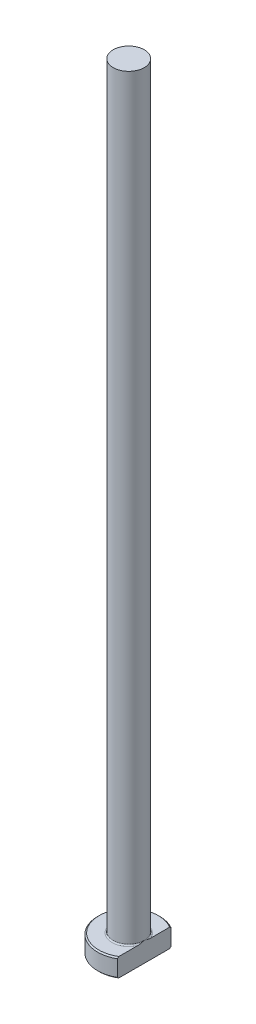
ISO-10303-21;
HEADER;
FILE_DESCRIPTION(('STEP AP214'),'2;1');
FILE_NAME('part.step','',(''),(''),'','','');
FILE_SCHEMA(('AUTOMOTIVE_DESIGN { 1 0 10303 214 1 1 1 1 }'));
ENDSEC;
DATA;
#1=APPLICATION_CONTEXT('core data for automotive mechanical design processes');
#2=APPLICATION_PROTOCOL_DEFINITION('international standard','automotive_design',2000,#1);
#3=PRODUCT_CONTEXT('',#1,'mechanical');
#4=PRODUCT('Part','Part','',(#3));
#5=PRODUCT_RELATED_PRODUCT_CATEGORY('part','',(#4));
#6=PRODUCT_DEFINITION_FORMATION('','',#4);
#7=PRODUCT_DEFINITION_CONTEXT('part definition',#1,'design');
#8=PRODUCT_DEFINITION('design','',#6,#7);
#9=PRODUCT_DEFINITION_SHAPE('','',#8);
#10=(LENGTH_UNIT() NAMED_UNIT(*) SI_UNIT(.MILLI.,.METRE.));
#11=(NAMED_UNIT(*) PLANE_ANGLE_UNIT() SI_UNIT($,.RADIAN.));
#12=(NAMED_UNIT(*) SI_UNIT($,.STERADIAN.) SOLID_ANGLE_UNIT());
#13=UNCERTAINTY_MEASURE_WITH_UNIT(LENGTH_MEASURE(1.E-05),#10,'distance_accuracy_value','');
#14=(GEOMETRIC_REPRESENTATION_CONTEXT(3) GLOBAL_UNCERTAINTY_ASSIGNED_CONTEXT((#13)) GLOBAL_UNIT_ASSIGNED_CONTEXT((#10,
#11,#12)) REPRESENTATION_CONTEXT('',''));
#15=CARTESIAN_POINT('',(0.,0.,0.));
#16=DIRECTION('',(0.,0.,1.));
#17=DIRECTION('',(1.,0.,0.));
#18=AXIS2_PLACEMENT_3D('',#15,#16,#17);
#19=CARTESIAN_POINT('',(0.,0.,0.));
#20=DIRECTION('',(0.,-1.,0.));
#21=DIRECTION('',(0.,0.,-1.));
#22=AXIS2_PLACEMENT_3D('',#19,#20,#21);
#23=PLANE('',#22);
#24=CARTESIAN_POINT('',(0.,0.,0.));
#25=DIRECTION('',(0.,-1.,0.));
#26=DIRECTION('',(0.,0.,-1.));
#27=AXIS2_PLACEMENT_3D('',#24,#25,#26);
#28=CIRCLE('',#27,4.79999999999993);
#29=CARTESIAN_POINT('',(2.49999999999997,0.,4.09756024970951));
#30=VERTEX_POINT('',#29);
#31=CARTESIAN_POINT('',(2.49999999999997,0.,-4.09756024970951));
#32=VERTEX_POINT('',#31);
#33=EDGE_CURVE('E98',#30,#32,#28,.T.);
#34=ORIENTED_EDGE('',*,*,#33,.T.);
#35=DIRECTION('',(0.,0.,1.));
#36=VECTOR('',#35,1.);
#37=CARTESIAN_POINT('',(2.49999999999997,0.,-4.33012701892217));
#38=LINE('',#37,#36);
#39=EDGE_CURVE('E83',#32,#30,#38,.T.);
#40=ORIENTED_EDGE('',*,*,#39,.T.);
#41=EDGE_LOOP('',(#34,#40));
#42=FACE_BOUND('',#41,.T.);
#43=ADVANCED_FACE('F32',(#42),#23,.T.);
#44=CARTESIAN_POINT('',(0.,259.958771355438,0.));
#45=DIRECTION('',(0.,1.,0.));
#46=DIRECTION('',(0.,0.,1.));
#47=AXIS2_PLACEMENT_3D('',#44,#45,#46);
#48=CYLINDRICAL_SURFACE('',#47,4.99999999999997);
#49=CARTESIAN_POINT('',(0.,2.80000000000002,0.));
#50=DIRECTION('',(0.,1.,0.));
#51=DIRECTION('',(0.,0.,1.));
#52=AXIS2_PLACEMENT_3D('',#49,#50,#51);
#53=CIRCLE('',#52,4.99999999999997);
#54=CARTESIAN_POINT('',(2.49999999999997,2.80000000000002,4.33012701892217));
#55=VERTEX_POINT('',#54);
#56=CARTESIAN_POINT('',(2.49999999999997,2.80000000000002,-4.33012701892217));
#57=VERTEX_POINT('',#56);
#58=EDGE_CURVE('E104',#55,#57,#53,.F.);
#59=ORIENTED_EDGE('',*,*,#58,.T.);
#60=DIRECTION('',(0.,-1.,0.));
#61=VECTOR('',#60,1.);
#62=CARTESIAN_POINT('',(2.49999999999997,125.,-4.33012701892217));
#63=LINE('',#62,#61);
#64=CARTESIAN_POINT('',(2.49999999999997,0.200000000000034,-4.33012701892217));
#65=VERTEX_POINT('',#64);
#66=EDGE_CURVE('E183',#57,#65,#63,.T.);
#67=ORIENTED_EDGE('',*,*,#66,.T.);
#68=CARTESIAN_POINT('',(0.,0.200000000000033,0.));
#69=DIRECTION('',(0.,-1.,0.));
#70=DIRECTION('',(0.,0.,-1.));
#71=AXIS2_PLACEMENT_3D('',#68,#69,#70);
#72=CIRCLE('',#71,4.99999999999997);
#73=CARTESIAN_POINT('',(2.49999999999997,0.200000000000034,4.33012701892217));
#74=VERTEX_POINT('',#73);
#75=EDGE_CURVE('E100',#65,#74,#72,.F.);
#76=ORIENTED_EDGE('',*,*,#75,.T.);
#77=DIRECTION('',(0.,-1.,0.));
#78=VECTOR('',#77,1.);
#79=CARTESIAN_POINT('',(2.49999999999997,125.,4.33012701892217));
#80=LINE('',#79,#78);
#81=EDGE_CURVE('E93',#55,#74,#80,.T.);
#82=ORIENTED_EDGE('',*,*,#81,.F.);
#83=EDGE_LOOP('',(#59,#67,#76,#82));
#84=FACE_BOUND('',#83,.T.);
#85=ADVANCED_FACE('F158',(#84),#48,.T.);
#86=CARTESIAN_POINT('',(-4.99999999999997,3.,0.));
#87=DIRECTION('',(0.,1.,0.));
#88=DIRECTION('',(0.,0.,1.));
#89=AXIS2_PLACEMENT_3D('',#86,#87,#88);
#90=PLANE('',#89);
#91=CARTESIAN_POINT('',(0.,3.,0.));
#92=DIRECTION('',(0.,1.,0.));
#93=DIRECTION('',(0.,0.,1.));
#94=AXIS2_PLACEMENT_3D('',#91,#92,#93);
#95=CIRCLE('',#94,4.79999999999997);
#96=CARTESIAN_POINT('',(2.49999999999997,3.,-4.09756024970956));
#97=VERTEX_POINT('',#96);
#98=CARTESIAN_POINT('',(2.49999999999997,3.,4.09756024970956));
#99=VERTEX_POINT('',#98);
#100=EDGE_CURVE('E178',#97,#99,#95,.T.);
#101=ORIENTED_EDGE('',*,*,#100,.T.);
#102=DIRECTION('',(0.,0.,-1.));
#103=VECTOR('',#102,1.);
#104=CARTESIAN_POINT('',(2.49999999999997,3.,0.));
#105=LINE('',#104,#103);
#106=CARTESIAN_POINT('',(2.49999999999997,2.99999999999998,1.01980390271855));
#107=VERTEX_POINT('',#106);
#108=EDGE_CURVE('E57',#99,#107,#105,.T.);
#109=ORIENTED_EDGE('',*,*,#108,.T.);
#110=CARTESIAN_POINT('',(0.,3.,0.));
#111=DIRECTION('',(0.,1.,0.));
#112=DIRECTION('',(0.,0.,1.));
#113=AXIS2_PLACEMENT_3D('',#110,#111,#112);
#114=CIRCLE('',#113,2.69999999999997);
#115=CARTESIAN_POINT('',(2.49999999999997,2.99999999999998,-1.01980390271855));
#116=VERTEX_POINT('',#115);
#117=EDGE_CURVE('E107',#107,#116,#114,.F.);
#118=ORIENTED_EDGE('',*,*,#117,.T.);
#119=EDGE_CURVE('E136',#116,#97,#105,.T.);
#120=ORIENTED_EDGE('',*,*,#119,.T.);
#121=EDGE_LOOP('',(#101,#109,#118,#120));
#122=FACE_BOUND('',#121,.T.);
#123=ADVANCED_FACE('F147',(#122),#90,.T.);
#124=CARTESIAN_POINT('',(0.,3.,0.));
#125=DIRECTION('',(0.,-1.,0.));
#126=DIRECTION('',(0.,0.,-1.));
#127=AXIS2_PLACEMENT_3D('',#124,#125,#126);
#128=CONICAL_SURFACE('',#127,4.79999999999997,0.785398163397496);
#129=ORIENTED_EDGE('',*,*,#58,.F.);
#130=CARTESIAN_POINT('',(2.49999999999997,-2.05039133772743,9.52786489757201));
#131=CARTESIAN_POINT('',(2.49999999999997,-1.84160367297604,9.31199733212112));
#132=CARTESIAN_POINT('',(2.49999999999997,-1.63304008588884,9.09591231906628));
#133=CARTESIAN_POINT('',(2.49999999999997,-1.21649358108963,8.66317810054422));
#134=CARTESIAN_POINT('',(2.49999999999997,-1.00851067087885,8.44652888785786));
#135=CARTESIAN_POINT('',(2.49999999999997,-0.593157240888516,8.01243155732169));
#136=CARTESIAN_POINT('',(2.49999999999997,-0.385787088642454,7.79498308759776));
#137=CARTESIAN_POINT('',(2.49999999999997,0.0280365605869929,7.3592177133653));
#138=CARTESIAN_POINT('',(2.49999999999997,0.234490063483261,7.14090081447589));
#139=CARTESIAN_POINT('',(2.49999999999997,0.642130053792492,6.70748960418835));
#140=CARTESIAN_POINT('',(2.49999999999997,0.843339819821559,6.49241720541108));
#141=CARTESIAN_POINT('',(2.49999999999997,1.24425381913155,6.06087422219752));
#142=CARTESIAN_POINT('',(2.49999999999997,1.44395806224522,5.84440364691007));
#143=CARTESIAN_POINT('',(2.49999999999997,1.8412775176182,5.40963663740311));
#144=CARTESIAN_POINT('',(2.49999999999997,2.03889317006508,5.19134060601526));
#145=CARTESIAN_POINT('',(2.49999999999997,2.43125043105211,4.75218509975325));
#146=CARTESIAN_POINT('',(2.49999999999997,2.62599215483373,4.53132572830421));
#147=CARTESIAN_POINT('',(2.49999999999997,2.93693788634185,4.17181619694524));
#148=CARTESIAN_POINT('',(2.49999999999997,3.05446493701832,4.03431188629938));
#149=CARTESIAN_POINT('',(2.49999999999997,3.28742704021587,3.75751486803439));
#150=CARTESIAN_POINT('',(2.49999999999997,3.4028618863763,3.618221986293));
#151=CARTESIAN_POINT('',(2.49999999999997,3.63213234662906,3.33586492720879));
#152=CARTESIAN_POINT('',(2.49999999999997,3.74593818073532,3.1927764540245));
#153=CARTESIAN_POINT('',(2.49999999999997,3.9695626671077,2.90356071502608));
#154=CARTESIAN_POINT('',(2.49999999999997,4.07938227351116,2.75743418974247));
#155=CARTESIAN_POINT('',(2.49999999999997,4.29502410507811,2.45881038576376));
#156=CARTESIAN_POINT('',(2.49999999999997,4.4007603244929,2.30625006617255));
#157=CARTESIAN_POINT('',(2.49999999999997,4.55286945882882,2.07299325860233));
#158=CARTESIAN_POINT('',(2.49999999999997,4.60252613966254,1.99444197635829));
#159=CARTESIAN_POINT('',(2.49999999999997,4.69908164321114,1.83566827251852));
#160=CARTESIAN_POINT('',(2.49999999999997,4.74598077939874,1.75544604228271));
#161=CARTESIAN_POINT('',(2.49999999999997,4.8357846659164,1.59405362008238));
#162=CARTESIAN_POINT('',(2.49999999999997,4.87873126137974,1.5129070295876));
#163=CARTESIAN_POINT('',(2.49999999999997,4.96038600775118,1.34852090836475));
#164=CARTESIAN_POINT('',(2.49999999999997,4.99909338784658,1.26528100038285));
#165=CARTESIAN_POINT('',(2.49999999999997,5.10703093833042,1.01251774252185));
#166=CARTESIAN_POINT('',(2.49999999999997,5.16843307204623,0.83934206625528));
#167=CARTESIAN_POINT('',(2.49999999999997,5.23490554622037,0.579703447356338));
#168=CARTESIAN_POINT('',(2.49999999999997,5.25253806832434,0.496421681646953));
#169=CARTESIAN_POINT('',(2.49999999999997,5.27986337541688,0.328535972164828));
#170=CARTESIAN_POINT('',(2.49999999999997,5.28955686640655,0.243932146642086));
#171=CARTESIAN_POINT('',(2.49999999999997,5.30031768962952,0.074434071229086));
#172=CARTESIAN_POINT('',(2.49999999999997,5.30141176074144,-0.0104584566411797));
#173=CARTESIAN_POINT('',(2.49999999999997,5.29496530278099,-0.179916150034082));
#174=CARTESIAN_POINT('',(2.49999999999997,5.28742406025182,-0.264481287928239));
#175=CARTESIAN_POINT('',(2.49999999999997,5.26433424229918,-0.431754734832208));
#176=CARTESIAN_POINT('',(2.49999999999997,5.24885436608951,-0.514472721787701));
#177=CARTESIAN_POINT('',(2.49999999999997,5.21085318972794,-0.678257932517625));
#178=CARTESIAN_POINT('',(2.49999999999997,5.18833104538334,-0.759324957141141));
#179=CARTESIAN_POINT('',(2.49999999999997,5.13718929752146,-0.920001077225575));
#180=CARTESIAN_POINT('',(2.49999999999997,5.10853534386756,-0.99959909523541));
#181=CARTESIAN_POINT('',(2.49999999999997,5.04628092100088,-1.15679278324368));
#182=CARTESIAN_POINT('',(2.49999999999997,5.01268146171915,-1.23438885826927));
#183=CARTESIAN_POINT('',(2.49999999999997,4.90558195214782,-1.46503672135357));
#184=CARTESIAN_POINT('',(2.49999999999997,4.82601567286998,-1.61526350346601));
#185=CARTESIAN_POINT('',(2.49999999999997,4.6563523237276,-1.90970759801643));
#186=CARTESIAN_POINT('',(2.49999999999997,4.56624199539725,-2.05391702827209));
#187=CARTESIAN_POINT('',(2.49999999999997,4.37862201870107,-2.33821627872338));
#188=CARTESIAN_POINT('',(2.49999999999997,4.28108460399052,-2.478287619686));
#189=CARTESIAN_POINT('',(2.49999999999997,4.0811627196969,-2.75478641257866));
#190=CARTESIAN_POINT('',(2.49999999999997,3.97878070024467,-2.89121565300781));
#191=CARTESIAN_POINT('',(2.49999999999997,3.76913910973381,-3.16313520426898));
#192=CARTESIAN_POINT('',(2.49999999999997,3.66183307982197,-3.29858952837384));
#193=CARTESIAN_POINT('',(2.49999999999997,3.44456217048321,-3.56736427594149));
#194=CARTESIAN_POINT('',(2.49999999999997,3.3345970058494,-3.7006844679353));
#195=CARTESIAN_POINT('',(2.49999999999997,3.11293465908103,-3.96532340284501));
#196=CARTESIAN_POINT('',(2.49999999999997,3.00124232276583,-4.09664621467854));
#197=CARTESIAN_POINT('',(2.49999999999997,2.77631276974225,-4.35796341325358));
#198=CARTESIAN_POINT('',(2.49999999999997,2.66307552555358,-4.48795777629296));
#199=CARTESIAN_POINT('',(2.49999999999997,2.36028773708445,-4.83228553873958));
#200=CARTESIAN_POINT('',(2.49999999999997,2.16967435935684,-5.04568363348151));
#201=CARTESIAN_POINT('',(2.49999999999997,1.78611780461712,-5.47037913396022));
#202=CARTESIAN_POINT('',(2.49999999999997,1.59317456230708,-5.68167648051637));
#203=CARTESIAN_POINT('',(2.49999999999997,1.20540648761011,-6.10290357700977));
#204=CARTESIAN_POINT('',(2.49999999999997,1.01058005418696,-6.31283185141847));
#205=CARTESIAN_POINT('',(2.49999999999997,0.619649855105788,-6.73149551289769));
#206=CARTESIAN_POINT('',(2.49999999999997,0.423546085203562,-6.94023089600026));
#207=CARTESIAN_POINT('',(2.49999999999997,0.0384434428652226,-7.34820392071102));
#208=CARTESIAN_POINT('',(2.49999999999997,-0.150515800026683,-7.54747899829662));
#209=CARTESIAN_POINT('',(2.49999999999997,-0.529153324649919,-7.94534601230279));
#210=CARTESIAN_POINT('',(2.49999999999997,-0.718831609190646,-8.14393794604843));
#211=CARTESIAN_POINT('',(2.49999999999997,-1.0985546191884,-8.54034636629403));
#212=CARTESIAN_POINT('',(2.49999999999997,-1.2885986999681,-8.73816347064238));
#213=CARTESIAN_POINT('',(2.49999999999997,-1.66916268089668,-9.13333639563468));
#214=CARTESIAN_POINT('',(2.49999999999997,-1.85968257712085,-9.33069222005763));
#215=CARTESIAN_POINT('',(2.49999999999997,-2.05039133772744,-9.52786489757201));
#216=B_SPLINE_CURVE_WITH_KNOTS('',3,(#130,#131,#132,#133,#134,#135,#136,#137,#138,#139,#140,
#141,#142,#143,#144,#145,#146,#147,#148,#149,#150,#151,#152,#153,#154,#155,#156,#157,#158,#159,
#160,#161,#162,#163,#164,#165,#166,#167,#168,#169,#170,#171,#172,#173,#174,#175,#176,#177,#178,
#179,#180,#181,#182,#183,#184,#185,#186,#187,#188,#189,#190,#191,#192,#193,#194,#195,#196,#197,
#198,#199,#200,#201,#202,#203,#204,#205,#206,#207,#208,#209,#210,#211,#212,#213,#214,#215),
.UNSPECIFIED.,.F.,.F.,(4,2,2,2,2,2,2,2,2,2,2,2,2,2,2,2,2,2,2,2,2,2,2,2,2,2,2,2,2,2,2,2,2,2,2,2,
2,2,2,2,2,2,4),(0.,0.900955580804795,1.8019227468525,2.70335062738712,3.60477268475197,
4.48832484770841,5.37187123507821,6.25522753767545,7.13854832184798,7.68119321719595,
8.22389134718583,8.77232299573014,9.32062249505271,9.87724663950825,10.1559936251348,
10.4347088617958,10.7100145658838,10.9853702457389,11.5339745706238,11.7890461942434,
12.0440951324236,12.2983507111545,12.5526272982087,12.8047396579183,13.0568822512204,
13.310476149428,13.5640183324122,14.0732618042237,14.5831526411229,15.0950533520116,
15.6066978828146,16.1250759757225,16.643509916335,17.1606868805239,17.6778730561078,
18.5362451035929,19.3946412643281,20.2538459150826,21.113053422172,21.9369112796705,
22.7607723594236,23.583714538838,24.4066499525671),.UNSPECIFIED.);
#217=EDGE_CURVE('E135',#55,#99,#216,.T.);
#218=ORIENTED_EDGE('',*,*,#217,.T.);
#219=ORIENTED_EDGE('',*,*,#100,.F.);
#220=EDGE_CURVE('E127',#97,#57,#216,.T.);
#221=ORIENTED_EDGE('',*,*,#220,.T.);
#222=EDGE_LOOP('',(#129,#218,#219,#221));
#223=FACE_BOUND('',#222,.T.);
#224=ADVANCED_FACE('F143',(#223),#128,.T.);
#225=CARTESIAN_POINT('',(0.,0.200000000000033,0.));
#226=DIRECTION('',(0.,1.,0.));
#227=DIRECTION('',(0.,0.,1.));
#228=AXIS2_PLACEMENT_3D('',#225,#226,#227);
#229=CONICAL_SURFACE('',#228,4.99999999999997,0.785398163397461);
#230=ORIENTED_EDGE('',*,*,#75,.F.);
#231=CARTESIAN_POINT('',(2.49999999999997,5.05039133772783,-9.52786489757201));
#232=CARTESIAN_POINT('',(2.49999999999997,4.84160367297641,-9.31199733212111));
#233=CARTESIAN_POINT('',(2.49999999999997,4.63304008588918,-9.09591231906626));
#234=CARTESIAN_POINT('',(2.49999999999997,4.21649358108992,-8.66317810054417));
#235=CARTESIAN_POINT('',(2.49999999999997,4.00851067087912,-8.4465288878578));
#236=CARTESIAN_POINT('',(2.49999999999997,3.59315724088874,-8.01243155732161));
#237=CARTESIAN_POINT('',(2.49999999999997,3.38578708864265,-7.79498308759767));
#238=CARTESIAN_POINT('',(2.49999999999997,2.97196343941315,-7.35921771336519));
#239=CARTESIAN_POINT('',(2.49999999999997,2.76550993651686,-7.14090081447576));
#240=CARTESIAN_POINT('',(2.49999999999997,2.35786994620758,-6.70748960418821));
#241=CARTESIAN_POINT('',(2.49999999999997,2.15666018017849,-6.49241720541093));
#242=CARTESIAN_POINT('',(2.49999999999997,1.75574618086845,-6.06087422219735));
#243=CARTESIAN_POINT('',(2.49999999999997,1.55604193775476,-5.84440364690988));
#244=CARTESIAN_POINT('',(2.49999999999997,1.15872248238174,-5.40963663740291));
#245=CARTESIAN_POINT('',(2.49999999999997,0.961106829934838,-5.19134060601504));
#246=CARTESIAN_POINT('',(2.49999999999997,0.568749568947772,-4.75218509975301));
#247=CARTESIAN_POINT('',(2.49999999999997,0.374007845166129,-4.53132572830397));
#248=CARTESIAN_POINT('',(2.49999999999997,0.0630621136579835,-4.171816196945));
#249=CARTESIAN_POINT('',(2.49999999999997,-0.054464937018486,-4.03431188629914));
#250=CARTESIAN_POINT('',(2.49999999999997,-0.287427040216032,-3.75751486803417));
#251=CARTESIAN_POINT('',(2.49999999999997,-0.402861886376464,-3.61822198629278));
#252=CARTESIAN_POINT('',(2.49999999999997,-0.632132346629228,-3.33586492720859));
#253=CARTESIAN_POINT('',(2.49999999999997,-0.745938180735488,-3.1927764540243));
#254=CARTESIAN_POINT('',(2.49999999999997,-0.969562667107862,-2.90356071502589));
#255=CARTESIAN_POINT('',(2.49999999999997,-1.07938227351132,-2.75743418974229));
#256=CARTESIAN_POINT('',(2.49999999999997,-1.29502410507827,-2.45881038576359));
#257=CARTESIAN_POINT('',(2.49999999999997,-1.40076032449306,-2.30625006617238));
#258=CARTESIAN_POINT('',(2.49999999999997,-1.55286945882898,-2.07299325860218));
#259=CARTESIAN_POINT('',(2.49999999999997,-1.6025261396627,-1.99444197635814));
#260=CARTESIAN_POINT('',(2.49999999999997,-1.6990816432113,-1.83566827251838));
#261=CARTESIAN_POINT('',(2.49999999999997,-1.7459807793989,-1.75544604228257));
#262=CARTESIAN_POINT('',(2.49999999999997,-1.83578466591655,-1.59405362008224));
#263=CARTESIAN_POINT('',(2.49999999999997,-1.8787312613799,-1.51290702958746));
#264=CARTESIAN_POINT('',(2.49999999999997,-1.96038600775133,-1.34852090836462));
#265=CARTESIAN_POINT('',(2.49999999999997,-1.99909338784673,-1.26528100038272));
#266=CARTESIAN_POINT('',(2.49999999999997,-2.10703093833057,-1.01251774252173));
#267=CARTESIAN_POINT('',(2.49999999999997,-2.16843307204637,-0.839342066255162));
#268=CARTESIAN_POINT('',(2.49999999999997,-2.2349055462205,-0.579703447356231));
#269=CARTESIAN_POINT('',(2.49999999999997,-2.25253806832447,-0.496421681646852));
#270=CARTESIAN_POINT('',(2.49999999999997,-2.279863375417,-0.328535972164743));
#271=CARTESIAN_POINT('',(2.49999999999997,-2.28955686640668,-0.243932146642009));
#272=CARTESIAN_POINT('',(2.49999999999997,-2.30031768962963,-0.0744340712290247));
#273=CARTESIAN_POINT('',(2.49999999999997,-2.30141176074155,0.010458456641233));
#274=CARTESIAN_POINT('',(2.49999999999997,-2.2949653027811,0.179916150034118));
#275=CARTESIAN_POINT('',(2.49999999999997,-2.28742406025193,0.264481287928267));
#276=CARTESIAN_POINT('',(2.49999999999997,-2.26433424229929,0.431754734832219));
#277=CARTESIAN_POINT('',(2.49999999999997,-2.24885436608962,0.514472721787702));
#278=CARTESIAN_POINT('',(2.49999999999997,-2.21085318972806,0.678257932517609));
#279=CARTESIAN_POINT('',(2.49999999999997,-2.18833104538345,0.759324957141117));
#280=CARTESIAN_POINT('',(2.49999999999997,-2.13718929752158,0.920001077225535));
#281=CARTESIAN_POINT('',(2.49999999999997,-2.10853534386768,0.999599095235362));
#282=CARTESIAN_POINT('',(2.49999999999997,-2.046280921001,1.15679278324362));
#283=CARTESIAN_POINT('',(2.49999999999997,-2.01268146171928,1.2343888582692));
#284=CARTESIAN_POINT('',(2.49999999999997,-1.90558195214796,1.46503672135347));
#285=CARTESIAN_POINT('',(2.49999999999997,-1.82601567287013,1.61526350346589));
#286=CARTESIAN_POINT('',(2.49999999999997,-1.65635232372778,1.90970759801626));
#287=CARTESIAN_POINT('',(2.49999999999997,-1.56624199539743,2.05391702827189));
#288=CARTESIAN_POINT('',(2.49999999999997,-1.37862201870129,2.33821627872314));
#289=CARTESIAN_POINT('',(2.49999999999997,-1.28108460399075,2.47828761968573));
#290=CARTESIAN_POINT('',(2.49999999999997,-1.08116271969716,2.75478641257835));
#291=CARTESIAN_POINT('',(2.49999999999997,-0.978780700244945,2.89121565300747));
#292=CARTESIAN_POINT('',(2.49999999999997,-0.76913910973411,3.16313520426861));
#293=CARTESIAN_POINT('',(2.49999999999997,-0.661833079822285,3.29858952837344));
#294=CARTESIAN_POINT('',(2.49999999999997,-0.444562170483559,3.56736427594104));
#295=CARTESIAN_POINT('',(2.49999999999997,-0.334597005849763,3.70068446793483));
#296=CARTESIAN_POINT('',(2.49999999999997,-0.112934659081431,3.9653234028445));
#297=CARTESIAN_POINT('',(2.49999999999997,-0.00124232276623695,4.09664621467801));
#298=CARTESIAN_POINT('',(2.49999999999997,0.223687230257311,4.357963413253));
#299=CARTESIAN_POINT('',(2.49999999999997,0.336924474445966,4.48795777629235));
#300=CARTESIAN_POINT('',(2.49999999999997,0.639712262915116,4.83228553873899));
#301=CARTESIAN_POINT('',(2.49999999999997,0.83032564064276,5.04568363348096));
#302=CARTESIAN_POINT('',(2.49999999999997,1.21388219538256,5.47037913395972));
#303=CARTESIAN_POINT('',(2.49999999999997,1.40682543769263,5.6816764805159));
#304=CARTESIAN_POINT('',(2.49999999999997,1.79459351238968,6.10290357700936));
#305=CARTESIAN_POINT('',(2.49999999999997,1.98941994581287,6.31283185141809));
#306=CARTESIAN_POINT('',(2.49999999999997,2.38035014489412,6.73149551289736));
#307=CARTESIAN_POINT('',(2.49999999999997,2.57645391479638,6.94023089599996));
#308=CARTESIAN_POINT('',(2.49999999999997,2.96155655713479,7.34820392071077));
#309=CARTESIAN_POINT('',(2.49999999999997,3.15051580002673,7.54747899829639));
#310=CARTESIAN_POINT('',(2.49999999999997,3.52915332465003,7.94534601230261));
#311=CARTESIAN_POINT('',(2.49999999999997,3.7188316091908,8.14393794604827));
#312=CARTESIAN_POINT('',(2.49999999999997,4.09855461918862,8.54034636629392));
#313=CARTESIAN_POINT('',(2.49999999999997,4.28859869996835,8.73816347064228));
#314=CARTESIAN_POINT('',(2.49999999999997,4.669162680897,9.13333639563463));
#315=CARTESIAN_POINT('',(2.49999999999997,4.85968257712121,9.33069222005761));
#316=CARTESIAN_POINT('',(2.49999999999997,5.05039133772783,9.52786489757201));
#317=B_SPLINE_CURVE_WITH_KNOTS('',3,(#231,#232,#233,#234,#235,#236,#237,#238,#239,#240,#241,
#242,#243,#244,#245,#246,#247,#248,#249,#250,#251,#252,#253,#254,#255,#256,#257,#258,#259,#260,
#261,#262,#263,#264,#265,#266,#267,#268,#269,#270,#271,#272,#273,#274,#275,#276,#277,#278,#279,
#280,#281,#282,#283,#284,#285,#286,#287,#288,#289,#290,#291,#292,#293,#294,#295,#296,#297,#298,
#299,#300,#301,#302,#303,#304,#305,#306,#307,#308,#309,#310,#311,#312,#313,#314,#315,#316),
.UNSPECIFIED.,.F.,.F.,(4,2,2,2,2,2,2,2,2,2,2,2,2,2,2,2,2,2,2,2,2,2,2,2,2,2,2,2,2,2,2,2,2,2,2,2,
2,2,2,2,2,2,4),(0.,0.900955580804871,1.80192274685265,2.70335062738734,3.60477268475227,
4.48832484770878,5.37187123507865,6.25522753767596,7.13854832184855,7.6811932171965,
8.22389134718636,8.77232299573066,9.32062249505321,9.87724663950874,10.1559936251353,
10.4347088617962,10.7100145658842,10.9853702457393,11.5339745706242,11.7890461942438,
12.044095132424,12.2983507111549,12.5526272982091,12.8047396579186,13.0568822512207,
13.3104761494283,13.5640183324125,14.0732618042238,14.583152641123,15.0950533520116,
15.6066978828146,16.1250759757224,16.6435099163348,17.1606868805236,17.6778730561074,
18.5362451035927,19.394641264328,20.2538459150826,21.1130534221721,21.9369112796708,
22.760772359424,23.5837145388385,24.4066499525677),.UNSPECIFIED.);
#318=EDGE_CURVE('E86',#65,#32,#317,.T.);
#319=ORIENTED_EDGE('',*,*,#318,.T.);
#320=ORIENTED_EDGE('',*,*,#33,.F.);
#321=EDGE_CURVE('E89',#30,#74,#317,.T.);
#322=ORIENTED_EDGE('',*,*,#321,.T.);
#323=EDGE_LOOP('',(#230,#319,#320,#322));
#324=FACE_BOUND('',#323,.T.);
#325=ADVANCED_FACE('F97',(#324),#229,.T.);
#326=CARTESIAN_POINT('',(0.,3.19999999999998,0.));
#327=DIRECTION('',(0.,1.,0.));
#328=DIRECTION('',(0.,0.,1.));
#329=AXIS2_PLACEMENT_3D('',#326,#327,#328);
#330=TOROIDAL_SURFACE('',#329,2.69999999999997,0.2);
#331=CARTESIAN_POINT('',(2.49999999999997,3.19999999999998,0.));
#332=CARTESIAN_POINT('',(2.49999999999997,3.20000050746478,5.29061312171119E-11));
#333=CARTESIAN_POINT('',(2.49999999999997,3.20000101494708,-1.70517157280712E-07));
#334=CARTESIAN_POINT('',(2.49999999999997,3.20000196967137,-6.59443804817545E-07));
#335=CARTESIAN_POINT('',(2.49999999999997,3.20000240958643,-9.87883924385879E-07));
#336=CARTESIAN_POINT('',(2.49999999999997,3.20000331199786,-1.7724689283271E-06));
#337=CARTESIAN_POINT('',(2.49999999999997,3.20000376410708,-2.24097229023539E-06));
#338=CARTESIAN_POINT('',(2.49999999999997,3.20000458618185,-3.2218605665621E-06));
#339=CARTESIAN_POINT('',(2.49999999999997,3.20000495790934,-3.73286586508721E-06));
#340=CARTESIAN_POINT('',(2.49999999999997,3.20000630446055,-5.67453781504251E-06));
#341=CARTESIAN_POINT('',(2.49999999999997,3.20000720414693,-7.15943624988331E-06));
#342=CARTESIAN_POINT('',(2.49999999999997,3.20000871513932,-1.01304383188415E-05));
#343=CARTESIAN_POINT('',(2.49999999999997,3.20000934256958,-1.16087237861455E-05));
#344=CARTESIAN_POINT('',(2.49999999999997,3.20001191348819,-1.77555555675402E-05));
#345=CARTESIAN_POINT('',(2.49999999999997,3.20001378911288,-2.24564506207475E-05));
#346=CARTESIAN_POINT('',(2.49999999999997,3.20001661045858,-3.14167101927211E-05));
#347=CARTESIAN_POINT('',(2.49999999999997,3.20001764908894,-3.56468503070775E-05));
#348=CARTESIAN_POINT('',(2.49999999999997,3.20002511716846,-6.67543462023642E-05));
#349=CARTESIAN_POINT('',(2.49999999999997,3.20003067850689,-9.37930225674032E-05));
#350=CARTESIAN_POINT('',(2.49999999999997,3.20005501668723,-0.000200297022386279));
#351=CARTESIAN_POINT('',(2.49999999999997,3.20007833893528,-0.000278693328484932));
#352=CARTESIAN_POINT('',(2.49999999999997,3.20016883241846,-0.000588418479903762));
#353=CARTESIAN_POINT('',(2.49999999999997,3.2002329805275,-0.000820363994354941));
#354=CARTESIAN_POINT('',(2.49999999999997,3.20048923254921,-0.00173961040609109));
#355=CARTESIAN_POINT('',(2.49999999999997,3.20068508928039,-0.00242612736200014));
#356=CARTESIAN_POINT('',(2.49999999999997,3.201497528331,-0.00528196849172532));
#357=CARTESIAN_POINT('',(2.49999999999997,3.20210941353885,-0.0074522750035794));
#358=CARTESIAN_POINT('',(2.49999999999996,3.20774599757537,-0.0274346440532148));
#359=CARTESIAN_POINT('',(2.49999999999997,3.21279017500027,-0.0452427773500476));
#360=CARTESIAN_POINT('',(2.49999999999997,3.22264347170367,-0.080167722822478));
#361=CARTESIAN_POINT('',(2.49999999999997,3.22745402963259,-0.0972841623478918));
#362=CARTESIAN_POINT('',(2.49999999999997,3.23763483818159,-0.133672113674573));
#363=CARTESIAN_POINT('',(2.49999999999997,3.24299975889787,-0.15294514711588));
#364=CARTESIAN_POINT('',(2.49999999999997,3.25370389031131,-0.191722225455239));
#365=CARTESIAN_POINT('',(2.49999999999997,3.25904219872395,-0.211226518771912));
#366=CARTESIAN_POINT('',(2.49999999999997,3.27184445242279,-0.258540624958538));
#367=CARTESIAN_POINT('',(2.49999999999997,3.27925018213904,-0.286366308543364));
#368=CARTESIAN_POINT('',(2.49999999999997,3.29355148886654,-0.341371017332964));
#369=CARTESIAN_POINT('',(2.49999999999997,3.30045534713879,-0.368547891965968));
#370=CARTESIAN_POINT('',(2.49999999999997,3.31991129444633,-0.447507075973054));
#371=CARTESIAN_POINT('',(2.49999999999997,3.33195369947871,-0.499417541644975));
#372=CARTESIAN_POINT('',(2.49999999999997,3.35404241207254,-0.60418810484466));
#373=CARTESIAN_POINT('',(2.49999999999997,3.36406867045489,-0.657052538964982));
#374=CARTESIAN_POINT('',(2.49999999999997,3.38176575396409,-0.767598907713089));
#375=CARTESIAN_POINT('',(2.49999999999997,3.38917909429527,-0.825323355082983));
#376=CARTESIAN_POINT('',(2.49999999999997,3.39884096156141,-0.94105511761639));
#377=CARTESIAN_POINT('',(2.49999999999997,3.40111055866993,-0.999060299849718));
#378=CARTESIAN_POINT('',(2.49999999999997,3.39847691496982,-1.09324578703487));
#379=CARTESIAN_POINT('',(2.49999999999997,3.39593644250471,-1.12948454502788));
#380=CARTESIAN_POINT('',(2.49999999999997,3.38674319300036,-1.20096926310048));
#381=CARTESIAN_POINT('',(2.49999999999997,3.38015410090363,-1.2362219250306));
#382=CARTESIAN_POINT('',(2.49999999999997,3.36639936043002,-1.28579148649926));
#383=CARTESIAN_POINT('',(2.49999999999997,3.36162670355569,-1.30076836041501));
#384=CARTESIAN_POINT('',(2.49999999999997,3.35062798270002,-1.33028325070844));
#385=CARTESIAN_POINT('',(2.49999999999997,3.34439458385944,-1.34481861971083));
#386=CARTESIAN_POINT('',(2.49999999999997,3.33003808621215,-1.37319413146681));
#387=CARTESIAN_POINT('',(2.49999999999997,3.32189015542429,-1.38702194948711));
#388=CARTESIAN_POINT('',(2.49999999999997,3.30325367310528,-1.4129811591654));
#389=CARTESIAN_POINT('',(2.49999999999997,3.2927824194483,-1.42512406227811));
#390=CARTESIAN_POINT('',(2.49999999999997,3.27569207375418,-1.44029611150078));
#391=CARTESIAN_POINT('',(2.49999999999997,3.27021837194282,-1.4446101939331));
#392=CARTESIAN_POINT('',(2.49999999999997,3.25870897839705,-1.45242709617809));
#393=CARTESIAN_POINT('',(2.49999999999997,3.25267333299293,-1.45592998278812));
#394=CARTESIAN_POINT('',(2.49999999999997,3.24001938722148,-1.46191450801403));
#395=CARTESIAN_POINT('',(2.49999999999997,3.233395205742,-1.46438399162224));
#396=CARTESIAN_POINT('',(2.49999999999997,3.21979347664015,-1.46798853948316));
#397=CARTESIAN_POINT('',(2.49999999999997,3.21281651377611,-1.46912574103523));
#398=CARTESIAN_POINT('',(2.49999999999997,3.19961348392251,-1.46988240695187));
#399=CARTESIAN_POINT('',(2.49999999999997,3.19339654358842,-1.46966594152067));
#400=CARTESIAN_POINT('',(2.49999999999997,3.18110362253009,-1.46811597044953));
#401=CARTESIAN_POINT('',(2.49999999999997,3.17502769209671,-1.46678207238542));
#402=CARTESIAN_POINT('',(2.49999999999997,3.16354702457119,-1.46323301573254));
#403=CARTESIAN_POINT('',(2.49999999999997,3.15812390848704,-1.46107586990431));
#404=CARTESIAN_POINT('',(2.49999999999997,3.14763458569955,-1.45603007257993));
#405=CARTESIAN_POINT('',(2.49999999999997,3.14256845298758,-1.45314127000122));
#406=CARTESIAN_POINT('',(2.49999999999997,3.12963191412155,-1.44468844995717));
#407=CARTESIAN_POINT('',(2.49999999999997,3.12209714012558,-1.43861122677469));
#408=CARTESIAN_POINT('',(2.49999999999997,3.10805350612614,-1.42536327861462));
#409=CARTESIAN_POINT('',(2.49999999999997,3.10154826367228,-1.418188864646));
#410=CARTESIAN_POINT('',(2.49999999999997,3.08513615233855,-1.39772885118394));
#411=CARTESIAN_POINT('',(2.49999999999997,3.07611692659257,-1.38373739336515));
#412=CARTESIAN_POINT('',(2.49999999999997,3.06018433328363,-1.35465370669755));
#413=CARTESIAN_POINT('',(2.49999999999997,3.0532724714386,-1.33956070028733));
#414=CARTESIAN_POINT('',(2.49999999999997,3.04107204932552,-1.30868385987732));
#415=CARTESIAN_POINT('',(2.49999999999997,3.03578911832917,-1.29289784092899));
#416=CARTESIAN_POINT('',(2.49999999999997,3.02655583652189,-1.26093375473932));
#417=CARTESIAN_POINT('',(2.49999999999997,3.0226069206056,-1.24475528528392));
#418=CARTESIAN_POINT('',(2.49999999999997,3.01232854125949,-1.19551094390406));
#419=CARTESIAN_POINT('',(2.49999999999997,3.00769429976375,-1.16209442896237));
#420=CARTESIAN_POINT('',(2.49999999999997,3.00005311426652,-1.07761506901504));
#421=CARTESIAN_POINT('',(2.49999999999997,2.99913690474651,-1.02638928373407));
#422=CARTESIAN_POINT('',(2.49999999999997,3.00223345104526,-0.923947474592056));
#423=CARTESIAN_POINT('',(2.49999999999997,3.00626667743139,-0.872732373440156));
#424=CARTESIAN_POINT('',(2.49999999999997,3.01749958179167,-0.773934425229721));
#425=CARTESIAN_POINT('',(2.49999999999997,3.02448410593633,-0.72632575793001));
#426=CARTESIAN_POINT('',(2.49999999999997,3.04066526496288,-0.631906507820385));
#427=CARTESIAN_POINT('',(2.49999999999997,3.0498429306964,-0.585092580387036));
#428=CARTESIAN_POINT('',(2.49999999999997,3.06791405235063,-0.500780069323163));
#429=CARTESIAN_POINT('',(2.49999999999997,3.07652349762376,-0.463219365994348));
#430=CARTESIAN_POINT('',(2.49999999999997,3.09478102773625,-0.387318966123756));
#431=CARTESIAN_POINT('',(2.49999999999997,3.10445029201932,-0.348984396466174));
#432=CARTESIAN_POINT('',(2.49999999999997,3.12135487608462,-0.284095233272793));
#433=CARTESIAN_POINT('',(2.49999999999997,3.12843710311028,-0.257500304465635));
#434=CARTESIAN_POINT('',(2.49999999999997,3.14273562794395,-0.204655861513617));
#435=CARTESIAN_POINT('',(2.49999999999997,3.1499496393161,-0.178405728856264));
#436=CARTESIAN_POINT('',(2.49999999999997,3.1636921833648,-0.128877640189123));
#437=CARTESIAN_POINT('',(2.49999999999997,3.17020707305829,-0.10559584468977));
#438=CARTESIAN_POINT('',(2.49999999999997,3.18358099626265,-0.0580847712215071));
#439=CARTESIAN_POINT('',(2.49999999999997,3.19044308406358,-0.033856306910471));
#440=CARTESIAN_POINT('',(2.49999999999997,3.19789108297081,-0.00745034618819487));
#441=CARTESIAN_POINT('',(2.49999999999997,3.198503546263,-0.00527812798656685));
#442=CARTESIAN_POINT('',(2.49999999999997,3.1993161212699,-0.0024218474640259));
#443=CARTESIAN_POINT('',(2.49999999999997,3.19951155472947,-0.00173680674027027));
#444=CARTESIAN_POINT('',(2.49999999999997,3.19976729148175,-0.000819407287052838));
#445=CARTESIAN_POINT('',(2.49999999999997,3.19983133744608,-0.00058783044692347));
#446=CARTESIAN_POINT('',(2.49999999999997,3.19992170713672,-0.000278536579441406));
#447=CARTESIAN_POINT('',(2.49999999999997,3.19994501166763,-0.000200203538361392));
#448=CARTESIAN_POINT('',(2.49999999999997,3.19996933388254,-9.3772760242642E-05));
#449=CARTESIAN_POINT('',(2.49999999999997,3.19997489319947,-6.67431741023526E-05));
#450=CARTESIAN_POINT('',(2.49999999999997,3.1999823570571,-3.56449049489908E-05));
#451=CARTESIAN_POINT('',(2.49999999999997,3.19998339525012,-3.14152905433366E-05));
#452=CARTESIAN_POINT('',(2.49999999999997,3.19998621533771,-2.24560901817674E-05));
#453=CARTESIAN_POINT('',(2.49999999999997,3.19998809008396,-1.77557009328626E-05));
#454=CARTESIAN_POINT('',(2.49999999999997,3.19999065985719,-1.16093871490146E-05));
#455=CARTESIAN_POINT('',(2.49999999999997,3.1999912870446,-1.01311410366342E-05));
#456=CARTESIAN_POINT('',(2.49999999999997,3.19999279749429,-7.16017592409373E-06));
#457=CARTESIAN_POINT('',(2.49999999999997,3.19999369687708,-5.67527054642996E-06));
#458=CARTESIAN_POINT('',(2.49999999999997,3.19999504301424,-3.73354014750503E-06));
#459=CARTESIAN_POINT('',(2.49999999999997,3.19999541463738,-3.22250653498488E-06));
#460=CARTESIAN_POINT('',(2.49999999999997,3.19999623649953,-2.24154280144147E-06));
#461=CARTESIAN_POINT('',(2.49999999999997,3.19999668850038,-1.77299174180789E-06));
#462=CARTESIAN_POINT('',(2.49999999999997,3.19999759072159,-9.88293774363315E-07));
#463=CARTESIAN_POINT('',(2.49999999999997,3.19999803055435,-6.59792278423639E-07));
#464=CARTESIAN_POINT('',(2.49999999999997,3.19999898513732,-1.7071215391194E-07));
#465=CARTESIAN_POINT('',(2.49999999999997,3.1999994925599,-5.29035539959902E-11));
#466=CARTESIAN_POINT('',(2.49999999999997,3.19999999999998,0.));
#467=B_SPLINE_CURVE_WITH_KNOTS('',3,(#331,#332,#333,#334,#335,#336,#337,#338,#339,#340,#341,
#342,#343,#344,#345,#346,#347,#348,#349,#350,#351,#352,#353,#354,#355,#356,#357,#358,#359,#360,
#361,#362,#363,#364,#365,#366,#367,#368,#369,#370,#371,#372,#373,#374,#375,#376,#377,#378,#379,
#380,#381,#382,#383,#384,#385,#386,#387,#388,#389,#390,#391,#392,#393,#394,#395,#396,#397,#398,
#399,#400,#401,#402,#403,#404,#405,#406,#407,#408,#409,#410,#411,#412,#413,#414,#415,#416,#417,
#418,#419,#420,#421,#422,#423,#424,#425,#426,#427,#428,#429,#430,#431,#432,#433,#434,#435,#436,
#437,#438,#439,#440,#441,#442,#443,#444,#445,#446,#447,#448,#449,#450,#451,#452,#453,#454,#455,
#456,#457,#458,#459,#460,#461,#462,#463,#464,#465,#466),.UNSPECIFIED.,.T.,.F.,(4,2,2,2,2,2,2,2,
2,2,2,2,2,2,2,2,2,2,2,2,2,2,2,2,2,2,2,2,2,2,2,2,2,2,2,2,2,2,2,2,2,2,2,2,2,2,2,2,2,2,2,2,2,2,2,2,
2,2,2,2,2,2,2,2,2,2,2,4),(0.,1.53002989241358E-06,3.17429895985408E-06,5.11692917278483E-06,
7.01128942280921E-06,1.21993179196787E-05,1.70129966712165E-05,3.21659460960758E-05,
4.52166487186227E-05,0.000128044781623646,0.000373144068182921,0.00109538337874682,
0.00323676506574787,0.0100018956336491,0.0655261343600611,0.118865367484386,0.178882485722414,
0.239547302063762,0.325928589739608,0.410047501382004,0.56988542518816,0.731241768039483,
0.905704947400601,1.07945217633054,1.18829443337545,1.2954669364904,1.34257193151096,
1.38991872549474,1.43791728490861,1.4855698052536,1.50642342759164,1.52727533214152,
1.54836603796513,1.56942286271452,1.58798129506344,1.60654624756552,1.62399133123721,
1.64144002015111,1.67031274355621,1.69928476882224,1.74894310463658,1.79863683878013,
1.84850042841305,1.8984174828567,1.99938099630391,2.1527113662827,2.30667804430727,
2.45095908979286,2.59403470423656,2.70962861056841,2.8282269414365,2.91079145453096,
2.99246070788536,3.06498967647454,3.14053132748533,3.14730244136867,3.14943921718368,
3.15016030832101,3.15040521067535,3.15048801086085,3.15050105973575,3.1505162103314,
3.15052102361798,3.15052621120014,3.1505281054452,3.15053004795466,3.15053169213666,
3.15053322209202),.UNSPECIFIED.);
#468=CARTESIAN_POINT('',(2.49999999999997,3.19999999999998,0.));
#469=VERTEX_POINT('',#468);
#470=EDGE_CURVE('E11',#116,#469,#467,.T.);
#471=ORIENTED_EDGE('',*,*,#470,.F.);
#472=ORIENTED_EDGE('',*,*,#117,.F.);
#473=CARTESIAN_POINT('',(2.49999999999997,3.19999999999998,0.));
#474=CARTESIAN_POINT('',(2.49999999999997,3.19999949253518,-5.29060891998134E-11));
#475=CARTESIAN_POINT('',(2.49999999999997,3.19999898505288,1.70517157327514E-07));
#476=CARTESIAN_POINT('',(2.49999999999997,3.19999803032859,6.59443804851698E-07));
#477=CARTESIAN_POINT('',(2.49999999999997,3.19999759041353,9.87883924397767E-07));
#478=CARTESIAN_POINT('',(2.49999999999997,3.19999668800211,1.77246892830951E-06));
#479=CARTESIAN_POINT('',(2.49999999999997,3.19999623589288,2.24097229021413E-06));
#480=CARTESIAN_POINT('',(2.49999999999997,3.19999541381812,3.22186056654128E-06));
#481=CARTESIAN_POINT('',(2.49999999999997,3.19999504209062,3.73286586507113E-06));
#482=CARTESIAN_POINT('',(2.49999999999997,3.19999369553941,5.67453781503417E-06));
#483=CARTESIAN_POINT('',(2.49999999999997,3.19999279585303,7.15943624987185E-06));
#484=CARTESIAN_POINT('',(2.49999999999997,3.19999128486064,1.01304383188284E-05));
#485=CARTESIAN_POINT('',(2.49999999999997,3.19999065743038,1.1608723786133E-05));
#486=CARTESIAN_POINT('',(2.49999999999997,3.19998808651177,1.77555555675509E-05));
#487=CARTESIAN_POINT('',(2.49999999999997,3.19998621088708,2.24564506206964E-05));
#488=CARTESIAN_POINT('',(2.49999999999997,3.19998338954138,3.14167101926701E-05));
#489=CARTESIAN_POINT('',(2.49999999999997,3.19998235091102,3.56468503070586E-05));
#490=CARTESIAN_POINT('',(2.49999999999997,3.19997488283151,6.67543462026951E-05));
#491=CARTESIAN_POINT('',(2.49999999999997,3.19996932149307,9.37930225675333E-05));
#492=CARTESIAN_POINT('',(2.49999999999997,3.19994498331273,0.000200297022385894));
#493=CARTESIAN_POINT('',(2.49999999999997,3.19992166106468,0.000278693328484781));
#494=CARTESIAN_POINT('',(2.49999999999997,3.1998311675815,0.000588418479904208));
#495=CARTESIAN_POINT('',(2.49999999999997,3.19976701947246,0.000820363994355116));
#496=CARTESIAN_POINT('',(2.49999999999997,3.19951076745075,0.00173961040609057));
#497=CARTESIAN_POINT('',(2.49999999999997,3.19931491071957,0.00242612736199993));
#498=CARTESIAN_POINT('',(2.49999999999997,3.19850247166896,0.00528196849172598));
#499=CARTESIAN_POINT('',(2.49999999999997,3.19789058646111,0.00745227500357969));
#500=CARTESIAN_POINT('',(2.49999999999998,3.19225400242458,0.0274346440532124));
#501=CARTESIAN_POINT('',(2.49999999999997,3.18720982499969,0.045242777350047));
#502=CARTESIAN_POINT('',(2.49999999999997,3.17735652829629,0.0801677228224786));
#503=CARTESIAN_POINT('',(2.49999999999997,3.17254597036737,0.0972841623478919));
#504=CARTESIAN_POINT('',(2.49999999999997,3.16236516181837,0.133672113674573));
#505=CARTESIAN_POINT('',(2.49999999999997,3.15700024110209,0.15294514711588));
#506=CARTESIAN_POINT('',(2.49999999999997,3.14629610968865,0.191722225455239));
#507=CARTESIAN_POINT('',(2.49999999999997,3.14095780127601,0.211226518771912));
#508=CARTESIAN_POINT('',(2.49999999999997,3.12815554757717,0.258540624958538));
#509=CARTESIAN_POINT('',(2.49999999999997,3.12074981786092,0.286366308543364));
#510=CARTESIAN_POINT('',(2.49999999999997,3.10644851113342,0.341371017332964));
#511=CARTESIAN_POINT('',(2.49999999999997,3.09954465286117,0.368547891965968));
#512=CARTESIAN_POINT('',(2.49999999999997,3.08008870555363,0.447507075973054));
#513=CARTESIAN_POINT('',(2.49999999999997,3.06804630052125,0.499417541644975));
#514=CARTESIAN_POINT('',(2.49999999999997,3.04595758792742,0.60418810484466));
#515=CARTESIAN_POINT('',(2.49999999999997,3.03593132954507,0.657052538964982));
#516=CARTESIAN_POINT('',(2.49999999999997,3.01823424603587,0.767598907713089));
#517=CARTESIAN_POINT('',(2.49999999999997,3.01082090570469,0.825323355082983));
#518=CARTESIAN_POINT('',(2.49999999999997,3.00115903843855,0.94105511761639));
#519=CARTESIAN_POINT('',(2.49999999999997,2.99888944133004,0.999060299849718));
#520=CARTESIAN_POINT('',(2.49999999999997,3.00152308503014,1.09324578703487));
#521=CARTESIAN_POINT('',(2.49999999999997,3.00406355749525,1.12948454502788));
#522=CARTESIAN_POINT('',(2.49999999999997,3.0132568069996,1.20096926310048));
#523=CARTESIAN_POINT('',(2.49999999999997,3.01984589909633,1.2362219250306));
#524=CARTESIAN_POINT('',(2.49999999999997,3.03360063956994,1.28579148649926));
#525=CARTESIAN_POINT('',(2.49999999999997,3.03837329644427,1.30076836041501));
#526=CARTESIAN_POINT('',(2.49999999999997,3.04937201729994,1.33028325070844));
#527=CARTESIAN_POINT('',(2.49999999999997,3.05560541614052,1.34481861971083));
#528=CARTESIAN_POINT('',(2.49999999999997,3.06996191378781,1.37319413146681));
#529=CARTESIAN_POINT('',(2.49999999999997,3.07810984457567,1.38702194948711));
#530=CARTESIAN_POINT('',(2.49999999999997,3.09674632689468,1.4129811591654));
#531=CARTESIAN_POINT('',(2.49999999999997,3.10721758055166,1.42512406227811));
#532=CARTESIAN_POINT('',(2.49999999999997,3.12430792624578,1.44029611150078));
#533=CARTESIAN_POINT('',(2.49999999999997,3.12978162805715,1.4446101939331));
#534=CARTESIAN_POINT('',(2.49999999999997,3.14129102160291,1.45242709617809));
#535=CARTESIAN_POINT('',(2.49999999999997,3.14732666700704,1.45592998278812));
#536=CARTESIAN_POINT('',(2.49999999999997,3.15998061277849,1.46191450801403));
#537=CARTESIAN_POINT('',(2.49999999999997,3.16660479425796,1.46438399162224));
#538=CARTESIAN_POINT('',(2.49999999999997,3.18020652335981,1.46798853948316));
#539=CARTESIAN_POINT('',(2.49999999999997,3.18718348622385,1.46912574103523));
#540=CARTESIAN_POINT('',(2.49999999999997,3.20038651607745,1.46988240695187));
#541=CARTESIAN_POINT('',(2.49999999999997,3.20660345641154,1.46966594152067));
#542=CARTESIAN_POINT('',(2.49999999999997,3.21889637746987,1.46811597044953));
#543=CARTESIAN_POINT('',(2.49999999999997,3.22497230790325,1.46678207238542));
#544=CARTESIAN_POINT('',(2.49999999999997,3.23645297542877,1.46323301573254));
#545=CARTESIAN_POINT('',(2.49999999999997,3.24187609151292,1.46107586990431));
#546=CARTESIAN_POINT('',(2.49999999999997,3.25236541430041,1.45603007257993));
#547=CARTESIAN_POINT('',(2.49999999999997,3.25743154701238,1.45314127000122));
#548=CARTESIAN_POINT('',(2.49999999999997,3.27036808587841,1.44468844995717));
#549=CARTESIAN_POINT('',(2.49999999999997,3.27790285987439,1.43861122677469));
#550=CARTESIAN_POINT('',(2.49999999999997,3.29194649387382,1.42536327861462));
#551=CARTESIAN_POINT('',(2.49999999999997,3.29845173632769,1.418188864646));
#552=CARTESIAN_POINT('',(2.49999999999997,3.31486384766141,1.39772885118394));
#553=CARTESIAN_POINT('',(2.49999999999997,3.3238830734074,1.38373739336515));
#554=CARTESIAN_POINT('',(2.49999999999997,3.33981566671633,1.35465370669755));
#555=CARTESIAN_POINT('',(2.49999999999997,3.34672752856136,1.33956070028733));
#556=CARTESIAN_POINT('',(2.49999999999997,3.35892795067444,1.30868385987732));
#557=CARTESIAN_POINT('',(2.49999999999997,3.36421088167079,1.29289784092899));
#558=CARTESIAN_POINT('',(2.49999999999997,3.37344416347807,1.26093375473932));
#559=CARTESIAN_POINT('',(2.49999999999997,3.37739307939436,1.24475528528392));
#560=CARTESIAN_POINT('',(2.49999999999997,3.38767145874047,1.19551094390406));
#561=CARTESIAN_POINT('',(2.49999999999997,3.39230570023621,1.16209442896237));
#562=CARTESIAN_POINT('',(2.49999999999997,3.39994688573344,1.07761506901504));
#563=CARTESIAN_POINT('',(2.49999999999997,3.40086309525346,1.02638928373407));
#564=CARTESIAN_POINT('',(2.49999999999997,3.3977665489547,0.923947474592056));
#565=CARTESIAN_POINT('',(2.49999999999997,3.39373332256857,0.872732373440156));
#566=CARTESIAN_POINT('',(2.49999999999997,3.38250041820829,0.773934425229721));
#567=CARTESIAN_POINT('',(2.49999999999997,3.37551589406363,0.72632575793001));
#568=CARTESIAN_POINT('',(2.49999999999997,3.35933473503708,0.631906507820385));
#569=CARTESIAN_POINT('',(2.49999999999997,3.35015706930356,0.585092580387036));
#570=CARTESIAN_POINT('',(2.49999999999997,3.33208594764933,0.500780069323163));
#571=CARTESIAN_POINT('',(2.49999999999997,3.3234765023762,0.463219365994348));
#572=CARTESIAN_POINT('',(2.49999999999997,3.30521897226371,0.387318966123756));
#573=CARTESIAN_POINT('',(2.49999999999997,3.29554970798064,0.348984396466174));
#574=CARTESIAN_POINT('',(2.49999999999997,3.27864512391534,0.284095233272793));
#575=CARTESIAN_POINT('',(2.49999999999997,3.27156289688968,0.257500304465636));
#576=CARTESIAN_POINT('',(2.49999999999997,3.25726437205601,0.204655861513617));
#577=CARTESIAN_POINT('',(2.49999999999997,3.25005036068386,0.178405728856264));
#578=CARTESIAN_POINT('',(2.49999999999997,3.23630781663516,0.128877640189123));
#579=CARTESIAN_POINT('',(2.49999999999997,3.22979292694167,0.10559584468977));
#580=CARTESIAN_POINT('',(2.49999999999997,3.21641900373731,0.0580847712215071));
#581=CARTESIAN_POINT('',(2.49999999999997,3.20955691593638,0.0338563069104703));
#582=CARTESIAN_POINT('',(2.49999999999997,3.20210891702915,0.00745034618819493));
#583=CARTESIAN_POINT('',(2.49999999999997,3.20149645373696,0.00527812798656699));
#584=CARTESIAN_POINT('',(2.49999999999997,3.20068387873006,0.00242184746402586));
#585=CARTESIAN_POINT('',(2.49999999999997,3.20048844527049,0.00173680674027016));
#586=CARTESIAN_POINT('',(2.49999999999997,3.20023270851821,0.000819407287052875));
#587=CARTESIAN_POINT('',(2.49999999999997,3.20016866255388,0.000587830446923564));
#588=CARTESIAN_POINT('',(2.49999999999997,3.20007829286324,0.000278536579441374));
#589=CARTESIAN_POINT('',(2.49999999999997,3.20005498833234,0.000200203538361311));
#590=CARTESIAN_POINT('',(2.49999999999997,3.20003066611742,9.37727602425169E-05));
#591=CARTESIAN_POINT('',(2.49999999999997,3.20002510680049,6.6743174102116E-05));
#592=CARTESIAN_POINT('',(2.49999999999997,3.20001764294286,3.56449049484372E-05));
#593=CARTESIAN_POINT('',(2.49999999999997,3.20001660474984,3.14152905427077E-05));
#594=CARTESIAN_POINT('',(2.49999999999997,3.20001378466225,2.24560901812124E-05));
#595=CARTESIAN_POINT('',(2.49999999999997,3.200011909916,1.77557009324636E-05));
#596=CARTESIAN_POINT('',(2.49999999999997,3.20000934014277,1.16093871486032E-05));
#597=CARTESIAN_POINT('',(2.49999999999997,3.20000871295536,1.01311410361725E-05));
#598=CARTESIAN_POINT('',(2.49999999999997,3.20000720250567,7.16017592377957E-06));
#599=CARTESIAN_POINT('',(2.49999999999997,3.20000630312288,5.67527054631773E-06));
#600=CARTESIAN_POINT('',(2.49999999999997,3.20000495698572,3.73354014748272E-06));
#601=CARTESIAN_POINT('',(2.49999999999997,3.20000458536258,3.22250653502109E-06));
#602=CARTESIAN_POINT('',(2.49999999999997,3.20000376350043,2.24154280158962E-06));
#603=CARTESIAN_POINT('',(2.49999999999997,3.20000331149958,1.77299174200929E-06));
#604=CARTESIAN_POINT('',(2.49999999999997,3.20000240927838,9.88293774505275E-07));
#605=CARTESIAN_POINT('',(2.49999999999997,3.20000196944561,6.59792278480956E-07));
#606=CARTESIAN_POINT('',(2.49999999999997,3.20000101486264,1.7071215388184E-07));
#607=CARTESIAN_POINT('',(2.49999999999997,3.20000050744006,5.29035119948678E-11));
#608=CARTESIAN_POINT('',(2.49999999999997,3.19999999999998,0.));
#609=B_SPLINE_CURVE_WITH_KNOTS('',3,(#473,#474,#475,#476,#477,#478,#479,#480,#481,#482,#483,
#484,#485,#486,#487,#488,#489,#490,#491,#492,#493,#494,#495,#496,#497,#498,#499,#500,#501,#502,
#503,#504,#505,#506,#507,#508,#509,#510,#511,#512,#513,#514,#515,#516,#517,#518,#519,#520,#521,
#522,#523,#524,#525,#526,#527,#528,#529,#530,#531,#532,#533,#534,#535,#536,#537,#538,#539,#540,
#541,#542,#543,#544,#545,#546,#547,#548,#549,#550,#551,#552,#553,#554,#555,#556,#557,#558,#559,
#560,#561,#562,#563,#564,#565,#566,#567,#568,#569,#570,#571,#572,#573,#574,#575,#576,#577,#578,
#579,#580,#581,#582,#583,#584,#585,#586,#587,#588,#589,#590,#591,#592,#593,#594,#595,#596,#597,
#598,#599,#600,#601,#602,#603,#604,#605,#606,#607,#608),.UNSPECIFIED.,.T.,.F.,(4,2,2,2,2,2,2,2,
2,2,2,2,2,2,2,2,2,2,2,2,2,2,2,2,2,2,2,2,2,2,2,2,2,2,2,2,2,2,2,2,2,2,2,2,2,2,2,2,2,2,2,2,2,2,2,2,
2,2,2,2,2,2,2,2,2,2,2,4),(0.,1.53002989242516E-06,3.17429895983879E-06,5.11692917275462E-06,
7.01128942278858E-06,1.21993179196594E-05,1.70129966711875E-05,3.21659460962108E-05,
4.52166487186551E-05,0.000128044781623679,0.000373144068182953,0.00109538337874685,
0.0032367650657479,0.0100018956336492,0.0655261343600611,0.118865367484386,0.178882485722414,
0.239547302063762,0.325928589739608,0.410047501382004,0.56988542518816,0.731241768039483,
0.905704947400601,1.07945217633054,1.18829443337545,1.2954669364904,1.34257193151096,
1.38991872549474,1.43791728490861,1.4855698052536,1.50642342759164,1.52727533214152,
1.54836603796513,1.56942286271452,1.58798129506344,1.60654624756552,1.62399133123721,
1.64144002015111,1.67031274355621,1.69928476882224,1.74894310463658,1.79863683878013,
1.84850042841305,1.8984174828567,1.99938099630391,2.1527113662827,2.30667804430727,
2.45095908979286,2.59403470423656,2.70962861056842,2.8282269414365,2.91079145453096,
2.99246070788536,3.06498967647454,3.14053132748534,3.14730244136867,3.14943921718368,
3.15016030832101,3.15040521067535,3.15048801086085,3.15050105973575,3.1505162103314,
3.15052102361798,3.15052621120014,3.1505281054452,3.15053004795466,3.15053169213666,
3.15053322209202),.UNSPECIFIED.);
#610=EDGE_CURVE('E46',#469,#107,#609,.T.);
#611=ORIENTED_EDGE('',*,*,#610,.F.);
#612=CARTESIAN_POINT('',(0.,3.19999999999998,0.));
#613=DIRECTION('',(0.,1.,0.));
#614=DIRECTION('',(0.,0.,1.));
#615=AXIS2_PLACEMENT_3D('',#612,#613,#614);
#616=CIRCLE('',#615,2.49999999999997);
#617=EDGE_CURVE('E103',#469,#469,#616,.T.);
#618=ORIENTED_EDGE('',*,*,#617,.F.);
#619=EDGE_LOOP('',(#471,#472,#611,#618));
#620=FACE_BOUND('',#619,.T.);
#621=ADVANCED_FACE('F34',(#620),#330,.F.);
#622=CARTESIAN_POINT('',(0.,259.958771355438,0.));
#623=DIRECTION('',(0.,1.,0.));
#624=DIRECTION('',(0.,0.,1.));
#625=AXIS2_PLACEMENT_3D('',#622,#623,#624);
#626=CYLINDRICAL_SURFACE('',#625,2.49999999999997);
#627=ORIENTED_EDGE('',*,*,#617,.T.);
#628=EDGE_LOOP('',(#627));
#629=FACE_BOUND('',#628,.T.);
#630=CARTESIAN_POINT('',(0.,125.,0.));
#631=DIRECTION('',(0.,1.,0.));
#632=DIRECTION('',(0.,0.,1.));
#633=AXIS2_PLACEMENT_3D('',#630,#631,#632);
#634=CIRCLE('',#633,2.49999999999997);
#635=CARTESIAN_POINT('',(0.,125.,2.49999999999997));
#636=VERTEX_POINT('',#635);
#637=EDGE_CURVE('E101',#636,#636,#634,.T.);
#638=ORIENTED_EDGE('',*,*,#637,.F.);
#639=EDGE_LOOP('',(#638));
#640=FACE_BOUND('',#639,.T.);
#641=ADVANCED_FACE('F155',(#629,#640),#626,.T.);
#642=CARTESIAN_POINT('',(-2.49999999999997,125.,0.));
#643=DIRECTION('',(0.,1.,0.));
#644=DIRECTION('',(0.,0.,1.));
#645=AXIS2_PLACEMENT_3D('',#642,#643,#644);
#646=PLANE('',#645);
#647=ORIENTED_EDGE('',*,*,#637,.T.);
#648=EDGE_LOOP('',(#647));
#649=FACE_BOUND('',#648,.T.);
#650=ADVANCED_FACE('F121',(#649),#646,.T.);
#651=CARTESIAN_POINT('',(2.49999999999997,125.,-4.33012701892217));
#652=DIRECTION('',(1.,0.,0.));
#653=DIRECTION('',(0.,0.,-1.));
#654=AXIS2_PLACEMENT_3D('',#651,#652,#653);
#655=PLANE('',#654);
#656=ORIENTED_EDGE('',*,*,#66,.F.);
#657=ORIENTED_EDGE('',*,*,#220,.F.);
#658=ORIENTED_EDGE('',*,*,#119,.F.);
#659=ORIENTED_EDGE('',*,*,#470,.T.);
#660=ORIENTED_EDGE('',*,*,#610,.T.);
#661=ORIENTED_EDGE('',*,*,#108,.F.);
#662=ORIENTED_EDGE('',*,*,#217,.F.);
#663=ORIENTED_EDGE('',*,*,#81,.T.);
#664=ORIENTED_EDGE('',*,*,#321,.F.);
#665=ORIENTED_EDGE('',*,*,#39,.F.);
#666=ORIENTED_EDGE('',*,*,#318,.F.);
#667=EDGE_LOOP('',(#656,#657,#658,#659,#660,#661,#662,#663,#664,#665,#666));
#668=FACE_BOUND('',#667,.T.);
#669=ADVANCED_FACE('F85',(#668),#655,.T.);
#670=CLOSED_SHELL('',(#43,#85,#123,#224,#325,#621,#641,#650,#669));
#671=MANIFOLD_SOLID_BREP('B2',#670);
#672=ADVANCED_BREP_SHAPE_REPRESENTATION('',(#18,#671),#14);
#673=SHAPE_DEFINITION_REPRESENTATION(#9,#672);
ENDSEC;
END-ISO-10303-21;
